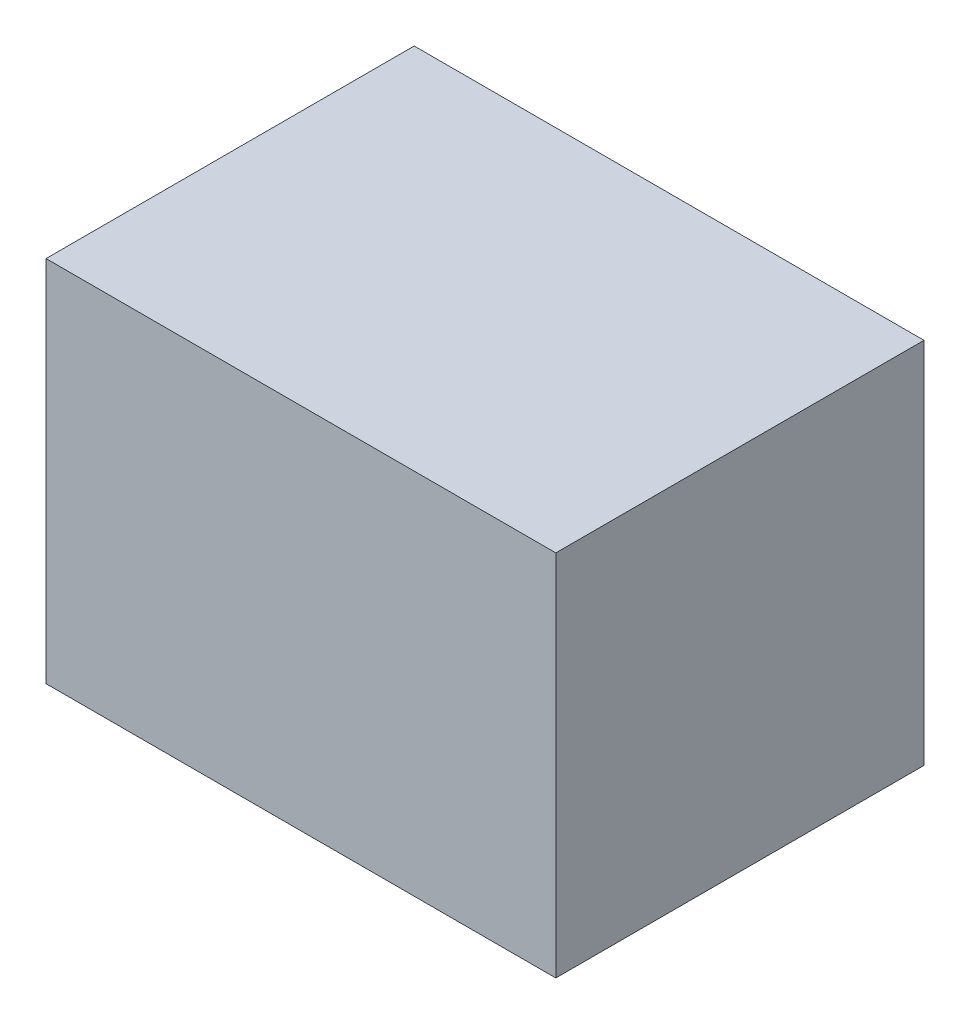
ISO-10303-21;
HEADER;
FILE_DESCRIPTION(('STEP AP214'),'2;1');
FILE_NAME('part.step','',(''),(''),'','','');
FILE_SCHEMA(('AUTOMOTIVE_DESIGN { 1 0 10303 214 1 1 1 1 }'));
ENDSEC;
DATA;
#1=APPLICATION_CONTEXT('core data for automotive mechanical design processes');
#2=APPLICATION_PROTOCOL_DEFINITION('international standard','automotive_design',2000,#1);
#3=PRODUCT_CONTEXT('',#1,'mechanical');
#4=PRODUCT('Part','Part','',(#3));
#5=PRODUCT_RELATED_PRODUCT_CATEGORY('part','',(#4));
#6=PRODUCT_DEFINITION_FORMATION('','',#4);
#7=PRODUCT_DEFINITION_CONTEXT('part definition',#1,'design');
#8=PRODUCT_DEFINITION('design','',#6,#7);
#9=PRODUCT_DEFINITION_SHAPE('','',#8);
#10=(LENGTH_UNIT() NAMED_UNIT(*) SI_UNIT(.MILLI.,.METRE.));
#11=(NAMED_UNIT(*) PLANE_ANGLE_UNIT() SI_UNIT($,.RADIAN.));
#12=(NAMED_UNIT(*) SI_UNIT($,.STERADIAN.) SOLID_ANGLE_UNIT());
#13=UNCERTAINTY_MEASURE_WITH_UNIT(LENGTH_MEASURE(1.E-05),#10,'distance_accuracy_value','');
#14=(GEOMETRIC_REPRESENTATION_CONTEXT(3) GLOBAL_UNCERTAINTY_ASSIGNED_CONTEXT((#13)) GLOBAL_UNIT_ASSIGNED_CONTEXT((#10,
#11,#12)) REPRESENTATION_CONTEXT('',''));
#15=CARTESIAN_POINT('',(0.,0.,0.));
#16=DIRECTION('',(0.,0.,1.));
#17=DIRECTION('',(1.,0.,0.));
#18=AXIS2_PLACEMENT_3D('',#15,#16,#17);
#19=CARTESIAN_POINT('',(2.286,3.302,1.651));
#20=DIRECTION('',(-1.,0.,0.));
#21=DIRECTION('',(0.,0.,1.));
#22=AXIS2_PLACEMENT_3D('',#19,#20,#21);
#23=PLANE('',#22);
#24=DIRECTION('',(0.,0.,-1.));
#25=VECTOR('',#24,1.);
#26=CARTESIAN_POINT('',(2.286,0.,1.651));
#27=LINE('',#26,#25);
#28=CARTESIAN_POINT('',(2.286,0.,1.651));
#29=VERTEX_POINT('',#28);
#30=CARTESIAN_POINT('',(2.286,0.,-1.651));
#31=VERTEX_POINT('',#30);
#32=EDGE_CURVE('E95',#29,#31,#27,.T.);
#33=ORIENTED_EDGE('',*,*,#32,.T.);
#34=DIRECTION('',(0.,-1.,0.));
#35=VECTOR('',#34,1.);
#36=CARTESIAN_POINT('',(2.286,3.302,-1.651));
#37=LINE('',#36,#35);
#38=CARTESIAN_POINT('',(2.286,3.302,-1.651));
#39=VERTEX_POINT('',#38);
#40=EDGE_CURVE('E11',#39,#31,#37,.T.);
#41=ORIENTED_EDGE('',*,*,#40,.F.);
#42=DIRECTION('',(0.,0.,-1.));
#43=VECTOR('',#42,1.);
#44=CARTESIAN_POINT('',(2.286,3.302,1.651));
#45=LINE('',#44,#43);
#46=CARTESIAN_POINT('',(2.286,3.302,1.651));
#47=VERTEX_POINT('',#46);
#48=EDGE_CURVE('E83',#47,#39,#45,.T.);
#49=ORIENTED_EDGE('',*,*,#48,.F.);
#50=DIRECTION('',(0.,-1.,0.));
#51=VECTOR('',#50,1.);
#52=CARTESIAN_POINT('',(2.286,3.302,1.651));
#53=LINE('',#52,#51);
#54=EDGE_CURVE('E91',#47,#29,#53,.T.);
#55=ORIENTED_EDGE('',*,*,#54,.T.);
#56=EDGE_LOOP('',(#33,#41,#49,#55));
#57=FACE_BOUND('',#56,.T.);
#58=ADVANCED_FACE('F32',(#57),#23,.F.);
#59=CARTESIAN_POINT('',(-2.286,3.302,-1.651));
#60=DIRECTION('',(0.,0.,1.));
#61=DIRECTION('',(1.,0.,0.));
#62=AXIS2_PLACEMENT_3D('',#59,#60,#61);
#63=PLANE('',#62);
#64=DIRECTION('',(-1.,0.,0.));
#65=VECTOR('',#64,1.);
#66=CARTESIAN_POINT('',(-2.286,0.,-1.651));
#67=LINE('',#66,#65);
#68=CARTESIAN_POINT('',(-2.286,0.,-1.651));
#69=VERTEX_POINT('',#68);
#70=EDGE_CURVE('E87',#31,#69,#67,.T.);
#71=ORIENTED_EDGE('',*,*,#70,.T.);
#72=DIRECTION('',(0.,-1.,0.));
#73=VECTOR('',#72,1.);
#74=CARTESIAN_POINT('',(-2.286,3.302,-1.651));
#75=LINE('',#74,#73);
#76=CARTESIAN_POINT('',(-2.286,3.302,-1.651));
#77=VERTEX_POINT('',#76);
#78=EDGE_CURVE('E40',#77,#69,#75,.T.);
#79=ORIENTED_EDGE('',*,*,#78,.F.);
#80=DIRECTION('',(-1.,0.,0.));
#81=VECTOR('',#80,1.);
#82=CARTESIAN_POINT('',(-2.286,3.302,-1.651));
#83=LINE('',#82,#81);
#84=EDGE_CURVE('E78',#39,#77,#83,.T.);
#85=ORIENTED_EDGE('',*,*,#84,.F.);
#86=ORIENTED_EDGE('',*,*,#40,.T.);
#87=EDGE_LOOP('',(#71,#79,#85,#86));
#88=FACE_BOUND('',#87,.T.);
#89=ADVANCED_FACE('F86',(#88),#63,.F.);
#90=CARTESIAN_POINT('',(-2.286,3.302,1.651));
#91=DIRECTION('',(1.,0.,0.));
#92=DIRECTION('',(0.,0.,-1.));
#93=AXIS2_PLACEMENT_3D('',#90,#91,#92);
#94=PLANE('',#93);
#95=DIRECTION('',(0.,0.,1.));
#96=VECTOR('',#95,1.);
#97=CARTESIAN_POINT('',(-2.286,0.,1.651));
#98=LINE('',#97,#96);
#99=CARTESIAN_POINT('',(-2.286,0.,1.651));
#100=VERTEX_POINT('',#99);
#101=EDGE_CURVE('E65',#69,#100,#98,.T.);
#102=ORIENTED_EDGE('',*,*,#101,.T.);
#103=DIRECTION('',(0.,-1.,0.));
#104=VECTOR('',#103,1.);
#105=CARTESIAN_POINT('',(-2.286,3.302,1.651));
#106=LINE('',#105,#104);
#107=CARTESIAN_POINT('',(-2.286,3.302,1.651));
#108=VERTEX_POINT('',#107);
#109=EDGE_CURVE('E88',#108,#100,#106,.T.);
#110=ORIENTED_EDGE('',*,*,#109,.F.);
#111=DIRECTION('',(0.,0.,1.));
#112=VECTOR('',#111,1.);
#113=CARTESIAN_POINT('',(-2.286,3.302,1.651));
#114=LINE('',#113,#112);
#115=EDGE_CURVE('E81',#77,#108,#114,.T.);
#116=ORIENTED_EDGE('',*,*,#115,.F.);
#117=ORIENTED_EDGE('',*,*,#78,.T.);
#118=EDGE_LOOP('',(#102,#110,#116,#117));
#119=FACE_BOUND('',#118,.T.);
#120=ADVANCED_FACE('F89',(#119),#94,.F.);
#121=CARTESIAN_POINT('',(-2.286,3.302,1.651));
#122=DIRECTION('',(0.,0.,-1.));
#123=DIRECTION('',(-1.,0.,0.));
#124=AXIS2_PLACEMENT_3D('',#121,#122,#123);
#125=PLANE('',#124);
#126=DIRECTION('',(1.,0.,0.));
#127=VECTOR('',#126,1.);
#128=CARTESIAN_POINT('',(-2.286,0.,1.651));
#129=LINE('',#128,#127);
#130=EDGE_CURVE('E71',#100,#29,#129,.T.);
#131=ORIENTED_EDGE('',*,*,#130,.T.);
#132=ORIENTED_EDGE('',*,*,#54,.F.);
#133=DIRECTION('',(1.,0.,0.));
#134=VECTOR('',#133,1.);
#135=CARTESIAN_POINT('',(-2.286,3.302,1.651));
#136=LINE('',#135,#134);
#137=EDGE_CURVE('E48',#108,#47,#136,.T.);
#138=ORIENTED_EDGE('',*,*,#137,.F.);
#139=ORIENTED_EDGE('',*,*,#109,.T.);
#140=EDGE_LOOP('',(#131,#132,#138,#139));
#141=FACE_BOUND('',#140,.T.);
#142=ADVANCED_FACE('F102',(#141),#125,.F.);
#143=CARTESIAN_POINT('',(0.,3.302,0.));
#144=DIRECTION('',(0.,-1.,0.));
#145=DIRECTION('',(0.,0.,-1.));
#146=AXIS2_PLACEMENT_3D('',#143,#144,#145);
#147=PLANE('',#146);
#148=ORIENTED_EDGE('',*,*,#48,.T.);
#149=ORIENTED_EDGE('',*,*,#84,.T.);
#150=ORIENTED_EDGE('',*,*,#115,.T.);
#151=ORIENTED_EDGE('',*,*,#137,.T.);
#152=EDGE_LOOP('',(#148,#149,#150,#151));
#153=FACE_BOUND('',#152,.T.);
#154=ADVANCED_FACE('F79',(#153),#147,.F.);
#155=CARTESIAN_POINT('',(0.,0.,0.));
#156=DIRECTION('',(0.,-1.,0.));
#157=DIRECTION('',(0.,0.,-1.));
#158=AXIS2_PLACEMENT_3D('',#155,#156,#157);
#159=PLANE('',#158);
#160=ORIENTED_EDGE('',*,*,#32,.F.);
#161=ORIENTED_EDGE('',*,*,#130,.F.);
#162=ORIENTED_EDGE('',*,*,#101,.F.);
#163=ORIENTED_EDGE('',*,*,#70,.F.);
#164=EDGE_LOOP('',(#160,#161,#162,#163));
#165=FACE_BOUND('',#164,.T.);
#166=ADVANCED_FACE('F105',(#165),#159,.T.);
#167=CLOSED_SHELL('',(#58,#89,#120,#142,#154,#166));
#168=MANIFOLD_SOLID_BREP('B2',#167);
#169=ADVANCED_BREP_SHAPE_REPRESENTATION('',(#18,#168),#14);
#170=SHAPE_DEFINITION_REPRESENTATION(#9,#169);
ENDSEC;
END-ISO-10303-21;
